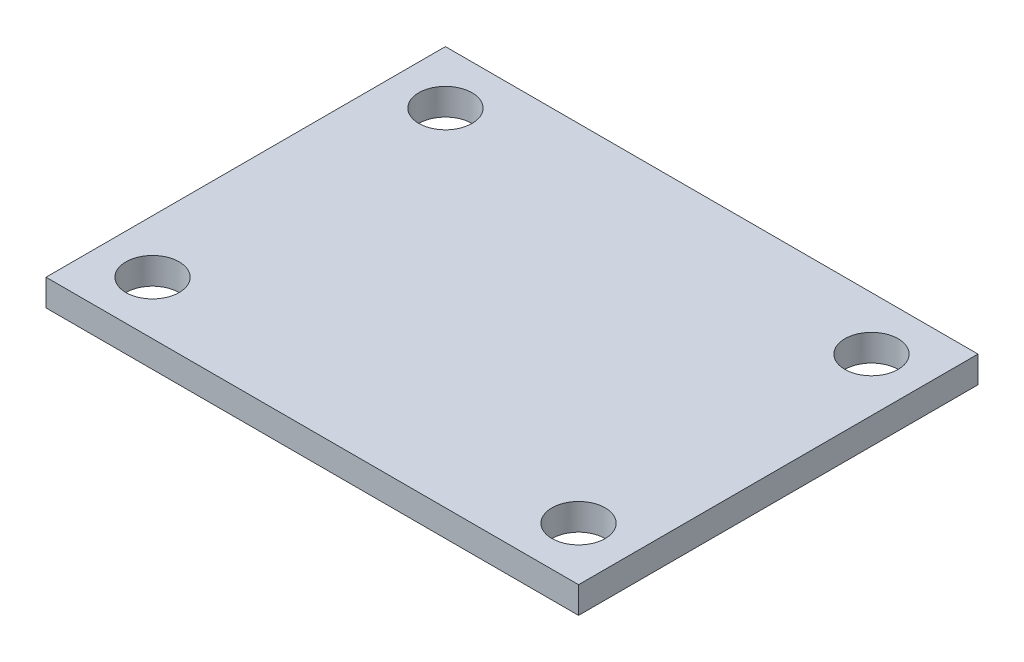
from build123d import *

# Parameters (mm, degrees)
SKETCH1_W           = 200
SKETCH1_H           = 150
BOSS_EXTRUDE1_DEPTH = 10
SKETCH2_R           = 10
CUT_EXTRUDE1_DEPTH  = 20


with BuildPart() as part:
    # Sketch1 → Boss-Extrude1 (new body)
    with BuildSketch(Plane(origin=(0, 0, 0), x_dir=(1, 0, 0), z_dir=(0, 1, 0))):
        Rectangle(SKETCH1_W, SKETCH1_H)
    extrude(amount=BOSS_EXTRUDE1_DEPTH)

    # Sketch2 → Cut-Extrude1 (cut)
    with BuildSketch(Plane(origin=(0, 10, 0), x_dir=(1, 0, 0), z_dir=(0, 1, 0))):
        with Locations(Location((-80, 55, 0), (0, 0, 270))):
            Circle(SKETCH2_R)
        with Locations(Location((80, 55, 0), (0, 0, 270))):
            Circle(SKETCH2_R)
        with Locations(Location((-80, -55, 0), (0, 0, 270))):
            Circle(SKETCH2_R)
        with Locations(Location((80, -55, 0), (0, 0, 270))):
            Circle(SKETCH2_R)
    extrude(amount=-CUT_EXTRUDE1_DEPTH, mode=Mode.SUBTRACT)


solid = part.part
